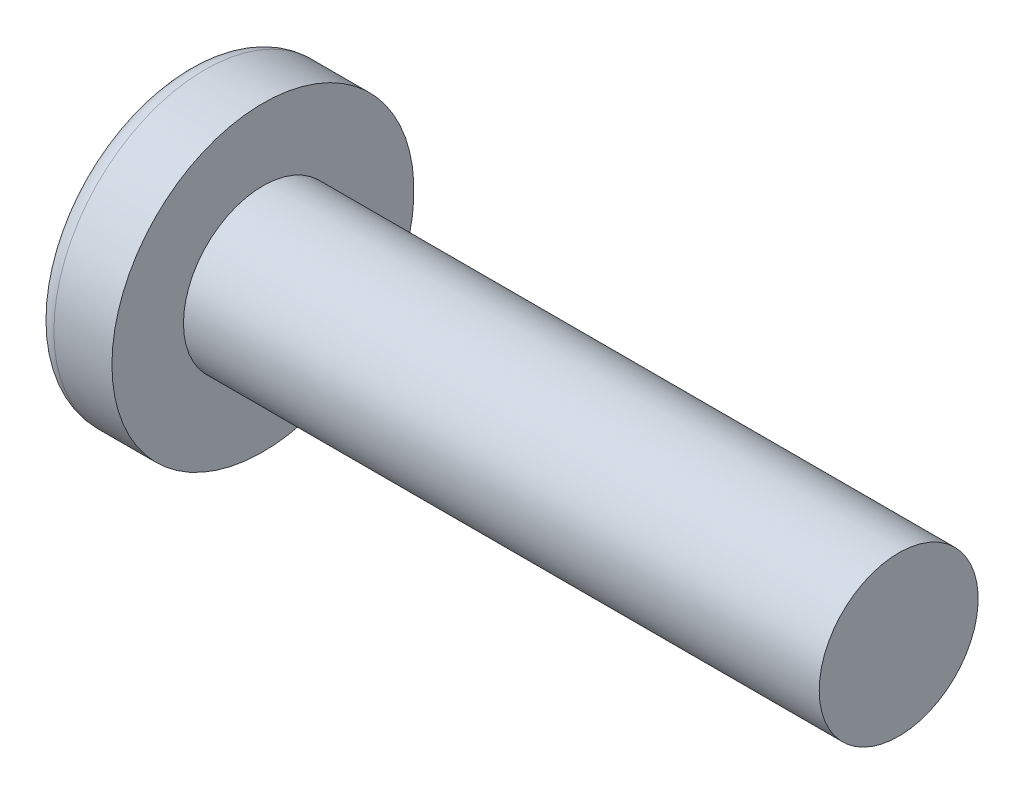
ISO-10303-21;
HEADER;
FILE_DESCRIPTION(('STEP AP214'),'2;1');
FILE_NAME('part.step','',(''),(''),'','','');
FILE_SCHEMA(('AUTOMOTIVE_DESIGN { 1 0 10303 214 1 1 1 1 }'));
ENDSEC;
DATA;
#1=APPLICATION_CONTEXT('core data for automotive mechanical design processes');
#2=APPLICATION_PROTOCOL_DEFINITION('international standard','automotive_design',2000,#1);
#3=PRODUCT_CONTEXT('',#1,'mechanical');
#4=PRODUCT('Part','Part','',(#3));
#5=PRODUCT_RELATED_PRODUCT_CATEGORY('part','',(#4));
#6=PRODUCT_DEFINITION_FORMATION('','',#4);
#7=PRODUCT_DEFINITION_CONTEXT('part definition',#1,'design');
#8=PRODUCT_DEFINITION('design','',#6,#7);
#9=PRODUCT_DEFINITION_SHAPE('','',#8);
#10=(LENGTH_UNIT() NAMED_UNIT(*) SI_UNIT(.MILLI.,.METRE.));
#11=(NAMED_UNIT(*) PLANE_ANGLE_UNIT() SI_UNIT($,.RADIAN.));
#12=(NAMED_UNIT(*) SI_UNIT($,.STERADIAN.) SOLID_ANGLE_UNIT());
#13=UNCERTAINTY_MEASURE_WITH_UNIT(LENGTH_MEASURE(1.E-05),#10,'distance_accuracy_value','');
#14=(GEOMETRIC_REPRESENTATION_CONTEXT(3) GLOBAL_UNCERTAINTY_ASSIGNED_CONTEXT((#13)) GLOBAL_UNIT_ASSIGNED_CONTEXT((#10,
#11,#12)) REPRESENTATION_CONTEXT('',''));
#15=CARTESIAN_POINT('',(0.,0.,0.));
#16=DIRECTION('',(0.,0.,1.));
#17=DIRECTION('',(1.,0.,0.));
#18=AXIS2_PLACEMENT_3D('',#15,#16,#17);
#19=CARTESIAN_POINT('',(8.,0.,0.));
#20=DIRECTION('',(-1.,0.,0.));
#21=DIRECTION('',(0.,1.,0.));
#22=AXIS2_PLACEMENT_3D('',#19,#20,#21);
#23=SPHERICAL_SURFACE('',#22,8.);
#24=CARTESIAN_POINT('',(1.37644815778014,0.,0.));
#25=DIRECTION('',(-1.,0.,0.));
#26=DIRECTION('',(0.,0.,1.));
#27=AXIS2_PLACEMENT_3D('',#24,#25,#26);
#28=CIRCLE('',#27,4.48648648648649);
#29=CARTESIAN_POINT('',(1.37644815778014,0.,4.48648648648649));
#30=VERTEX_POINT('',#29);
#31=EDGE_CURVE('E145',#30,#30,#28,.T.);
#32=ORIENTED_EDGE('',*,*,#31,.T.);
#33=EDGE_LOOP('',(#32));
#34=FACE_BOUND('',#33,.T.);
#35=CARTESIAN_POINT('',(7.98502567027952,-0.176697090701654,0.));
#36=DIRECTION('',(-0.0844430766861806,-0.996428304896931,0.));
#37=DIRECTION('',(0.996428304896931,-0.0844430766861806,0.));
#38=AXIS2_PLACEMENT_3D('',#35,#36,#37);
#39=CIRCLE('',#38,7.99803437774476);
#40=CARTESIAN_POINT('',(0.325131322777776,0.472446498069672,2.20752918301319));
#41=VERTEX_POINT('',#40);
#42=CARTESIAN_POINT('',(0.0309826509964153,0.497374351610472,0.497374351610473));
#43=VERTEX_POINT('',#42);
#44=EDGE_CURVE('E120',#41,#43,#39,.T.);
#45=ORIENTED_EDGE('',*,*,#44,.F.);
#46=CARTESIAN_POINT('',(6.31497138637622,0.,-2.25947018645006));
#47=DIRECTION('',(0.597823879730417,0.,0.801627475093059));
#48=DIRECTION('',(0.801627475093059,0.,-0.597823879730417));
#49=AXIS2_PLACEMENT_3D('',#46,#47,#48);
#50=CIRCLE('',#49,7.48702030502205);
#51=CARTESIAN_POINT('',(0.325131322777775,-0.472446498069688,2.20752918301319));
#52=VERTEX_POINT('',#51);
#53=EDGE_CURVE('E113',#41,#52,#50,.T.);
#54=ORIENTED_EDGE('',*,*,#53,.T.);
#55=CARTESIAN_POINT('',(7.98502567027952,0.176697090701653,0.));
#56=DIRECTION('',(-0.0844430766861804,0.996428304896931,0.));
#57=DIRECTION('',(-0.996428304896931,-0.0844430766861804,0.));
#58=AXIS2_PLACEMENT_3D('',#55,#56,#57);
#59=CIRCLE('',#58,7.99803437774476);
#60=CARTESIAN_POINT('',(0.0309826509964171,-0.497374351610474,0.497374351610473));
#61=VERTEX_POINT('',#60);
#62=EDGE_CURVE('E186',#61,#52,#59,.T.);
#63=ORIENTED_EDGE('',*,*,#62,.F.);
#64=CARTESIAN_POINT('',(7.98502567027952,0.,-0.176697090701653));
#65=DIRECTION('',(-0.0844430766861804,0.,-0.996428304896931));
#66=DIRECTION('',(-0.996428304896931,0.,0.0844430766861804));
#67=AXIS2_PLACEMENT_3D('',#64,#65,#66);
#68=CIRCLE('',#67,7.99803437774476);
#69=CARTESIAN_POINT('',(0.325131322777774,-2.20752918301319,0.472446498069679));
#70=VERTEX_POINT('',#69);
#71=EDGE_CURVE('E161',#70,#61,#68,.T.);
#72=ORIENTED_EDGE('',*,*,#71,.F.);
#73=CARTESIAN_POINT('',(6.31497138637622,2.25947018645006,0.));
#74=DIRECTION('',(0.597823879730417,-0.801627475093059,0.));
#75=DIRECTION('',(0.801627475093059,0.597823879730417,0.));
#76=AXIS2_PLACEMENT_3D('',#73,#74,#75);
#77=CIRCLE('',#76,7.48702030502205);
#78=CARTESIAN_POINT('',(0.325131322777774,-2.20752918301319,-0.47244649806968));
#79=VERTEX_POINT('',#78);
#80=EDGE_CURVE('E157',#70,#79,#77,.T.);
#81=ORIENTED_EDGE('',*,*,#80,.T.);
#82=CARTESIAN_POINT('',(7.98502567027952,0.,0.176697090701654));
#83=DIRECTION('',(-0.0844430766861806,0.,0.996428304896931));
#84=DIRECTION('',(0.996428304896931,0.,0.0844430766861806));
#85=AXIS2_PLACEMENT_3D('',#82,#83,#84);
#86=CIRCLE('',#85,7.99803437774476);
#87=CARTESIAN_POINT('',(0.0309826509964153,-0.497374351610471,-0.497374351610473));
#88=VERTEX_POINT('',#87);
#89=EDGE_CURVE('E41',#88,#79,#86,.T.);
#90=ORIENTED_EDGE('',*,*,#89,.F.);
#91=CARTESIAN_POINT('',(0.325131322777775,-0.472446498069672,-2.20752918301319));
#92=VERTEX_POINT('',#91);
#93=EDGE_CURVE('E183',#92,#88,#59,.T.);
#94=ORIENTED_EDGE('',*,*,#93,.F.);
#95=CARTESIAN_POINT('',(6.31497138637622,0.,2.25947018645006));
#96=DIRECTION('',(0.597823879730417,0.,-0.801627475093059));
#97=DIRECTION('',(-0.801627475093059,0.,-0.597823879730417));
#98=AXIS2_PLACEMENT_3D('',#95,#96,#97);
#99=CIRCLE('',#98,7.48702030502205);
#100=CARTESIAN_POINT('',(0.325131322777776,0.472446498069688,-2.20752918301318));
#101=VERTEX_POINT('',#100);
#102=EDGE_CURVE('E176',#92,#101,#99,.T.);
#103=ORIENTED_EDGE('',*,*,#102,.T.);
#104=CARTESIAN_POINT('',(0.0309826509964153,0.497374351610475,-0.497374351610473));
#105=VERTEX_POINT('',#104);
#106=EDGE_CURVE('E98',#105,#101,#39,.T.);
#107=ORIENTED_EDGE('',*,*,#106,.F.);
#108=CARTESIAN_POINT('',(0.325131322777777,2.20752918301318,-0.47244649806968));
#109=VERTEX_POINT('',#108);
#110=EDGE_CURVE('E34',#109,#105,#86,.T.);
#111=ORIENTED_EDGE('',*,*,#110,.F.);
#112=CARTESIAN_POINT('',(6.31497138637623,-2.25947018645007,0.));
#113=DIRECTION('',(0.597823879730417,0.801627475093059,0.));
#114=DIRECTION('',(-0.801627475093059,0.597823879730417,0.));
#115=AXIS2_PLACEMENT_3D('',#112,#113,#114);
#116=CIRCLE('',#115,7.48702030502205);
#117=CARTESIAN_POINT('',(0.325131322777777,2.20752918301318,0.47244649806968));
#118=VERTEX_POINT('',#117);
#119=EDGE_CURVE('E11',#109,#118,#116,.T.);
#120=ORIENTED_EDGE('',*,*,#119,.T.);
#121=EDGE_CURVE('E160',#43,#118,#68,.T.);
#122=ORIENTED_EDGE('',*,*,#121,.F.);
#123=EDGE_LOOP('',(#45,#54,#63,#72,#81,#90,#94,#103,#107,#111,#120,#122));
#124=FACE_BOUND('',#123,.T.);
#125=ADVANCED_FACE('F26',(#34,#124),#23,.T.);
#126=CARTESIAN_POINT('',(3.28522727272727,0.,-0.221590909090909));
#127=DIRECTION('',(-0.0844430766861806,0.,0.996428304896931));
#128=DIRECTION('',(0.996428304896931,0.,0.0844430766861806));
#129=AXIS2_PLACEMENT_3D('',#126,#127,#128);
#130=PLANE('',#129);
#131=ORIENTED_EDGE('',*,*,#110,.T.);
#132=DIRECTION('',(0.992894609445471,-0.0841436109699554,0.0841436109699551));
#133=VECTOR('',#132,1.);
#134=CARTESIAN_POINT('',(3.30374024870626,0.220022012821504,-0.220022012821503));
#135=LINE('',#134,#133);
#136=CARTESIAN_POINT('',(2.95,0.250000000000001,-0.249999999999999));
#137=VERTEX_POINT('',#136);
#138=EDGE_CURVE('E96',#105,#137,#135,.T.);
#139=ORIENTED_EDGE('',*,*,#138,.T.);
#140=DIRECTION('',(0.799784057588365,-0.596449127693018,0.0677783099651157));
#141=VECTOR('',#140,1.);
#142=CARTESIAN_POINT('',(0.,2.45,-0.5));
#143=LINE('',#142,#141);
#144=EDGE_CURVE('E118',#109,#137,#143,.T.);
#145=ORIENTED_EDGE('',*,*,#144,.F.);
#146=EDGE_LOOP('',(#131,#139,#145));
#147=FACE_BOUND('',#146,.T.);
#148=ADVANCED_FACE('F117',(#147),#130,.T.);
#149=DIRECTION('',(0.799784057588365,0.596449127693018,0.0677783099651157));
#150=VECTOR('',#149,1.);
#151=CARTESIAN_POINT('',(0.,-2.45,-0.5));
#152=LINE('',#151,#150);
#153=CARTESIAN_POINT('',(2.95,-0.25,-0.25));
#154=VERTEX_POINT('',#153);
#155=EDGE_CURVE('E139',#79,#154,#152,.T.);
#156=ORIENTED_EDGE('',*,*,#155,.T.);
#157=DIRECTION('',(-0.992894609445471,-0.0841436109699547,-0.0841436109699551));
#158=VECTOR('',#157,1.);
#159=CARTESIAN_POINT('',(3.30374024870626,-0.220022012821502,-0.220022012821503));
#160=LINE('',#159,#158);
#161=EDGE_CURVE('E184',#154,#88,#160,.T.);
#162=ORIENTED_EDGE('',*,*,#161,.T.);
#163=ORIENTED_EDGE('',*,*,#89,.T.);
#164=EDGE_LOOP('',(#156,#162,#163));
#165=FACE_BOUND('',#164,.T.);
#166=ADVANCED_FACE('F218',(#165),#130,.T.);
#167=CARTESIAN_POINT('',(3.28522727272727,0.,0.221590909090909));
#168=DIRECTION('',(-0.0844430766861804,0.,-0.996428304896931));
#169=DIRECTION('',(-0.996428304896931,0.,0.0844430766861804));
#170=AXIS2_PLACEMENT_3D('',#167,#168,#169);
#171=PLANE('',#170);
#172=DIRECTION('',(0.799784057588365,-0.596449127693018,-0.0677783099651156));
#173=VECTOR('',#172,1.);
#174=CARTESIAN_POINT('',(0.,2.45,0.5));
#175=LINE('',#174,#173);
#176=CARTESIAN_POINT('',(2.95,0.25,0.25));
#177=VERTEX_POINT('',#176);
#178=EDGE_CURVE('E125',#118,#177,#175,.T.);
#179=ORIENTED_EDGE('',*,*,#178,.T.);
#180=DIRECTION('',(-0.992894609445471,0.0841436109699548,0.084143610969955));
#181=VECTOR('',#180,1.);
#182=CARTESIAN_POINT('',(3.30374024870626,0.220022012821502,0.220022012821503));
#183=LINE('',#182,#181);
#184=EDGE_CURVE('E172',#177,#43,#183,.T.);
#185=ORIENTED_EDGE('',*,*,#184,.T.);
#186=ORIENTED_EDGE('',*,*,#121,.T.);
#187=EDGE_LOOP('',(#179,#185,#186));
#188=FACE_BOUND('',#187,.T.);
#189=ADVANCED_FACE('F170',(#188),#171,.T.);
#190=ORIENTED_EDGE('',*,*,#71,.T.);
#191=DIRECTION('',(0.992894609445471,0.0841436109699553,-0.0841436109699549));
#192=VECTOR('',#191,1.);
#193=CARTESIAN_POINT('',(3.30374024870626,-0.220022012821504,0.220022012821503));
#194=LINE('',#193,#192);
#195=CARTESIAN_POINT('',(2.95,-0.250000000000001,0.249999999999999));
#196=VERTEX_POINT('',#195);
#197=EDGE_CURVE('E189',#61,#196,#194,.T.);
#198=ORIENTED_EDGE('',*,*,#197,.T.);
#199=DIRECTION('',(0.799784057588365,0.596449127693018,-0.0677783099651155));
#200=VECTOR('',#199,1.);
#201=CARTESIAN_POINT('',(0.,-2.45,0.499999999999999));
#202=LINE('',#201,#200);
#203=EDGE_CURVE('E136',#70,#196,#202,.T.);
#204=ORIENTED_EDGE('',*,*,#203,.F.);
#205=EDGE_LOOP('',(#190,#198,#204));
#206=FACE_BOUND('',#205,.T.);
#207=ADVANCED_FACE('F237',(#206),#171,.T.);
#208=CARTESIAN_POINT('',(-25.4,0.,0.));
#209=DIRECTION('',(-1.,0.,0.));
#210=DIRECTION('',(0.,0.,1.));
#211=AXIS2_PLACEMENT_3D('',#208,#209,#210);
#212=CYLINDRICAL_SURFACE('',#211,2.5);
#213=CARTESIAN_POINT('',(23.7,0.,0.));
#214=DIRECTION('',(-1.,0.,0.));
#215=DIRECTION('',(0.,0.,1.));
#216=AXIS2_PLACEMENT_3D('',#213,#214,#215);
#217=CIRCLE('',#216,2.5);
#218=CARTESIAN_POINT('',(23.7,0.,2.5));
#219=VERTEX_POINT('',#218);
#220=EDGE_CURVE('E124',#219,#219,#217,.T.);
#221=ORIENTED_EDGE('',*,*,#220,.T.);
#222=EDGE_LOOP('',(#221));
#223=FACE_BOUND('',#222,.T.);
#224=CARTESIAN_POINT('',(3.7,0.,0.));
#225=DIRECTION('',(-1.,0.,0.));
#226=DIRECTION('',(0.,0.,1.));
#227=AXIS2_PLACEMENT_3D('',#224,#225,#226);
#228=CIRCLE('',#227,2.5);
#229=CARTESIAN_POINT('',(3.7,0.,2.5));
#230=VERTEX_POINT('',#229);
#231=EDGE_CURVE('E154',#230,#230,#228,.T.);
#232=ORIENTED_EDGE('',*,*,#231,.F.);
#233=EDGE_LOOP('',(#232));
#234=FACE_BOUND('',#233,.T.);
#235=ADVANCED_FACE('F28',(#223,#234),#212,.T.);
#236=CARTESIAN_POINT('',(3.7,2.5,0.));
#237=DIRECTION('',(-1.,0.,0.));
#238=DIRECTION('',(0.,0.,1.));
#239=AXIS2_PLACEMENT_3D('',#236,#237,#238);
#240=PLANE('',#239);
#241=CARTESIAN_POINT('',(3.7,0.,0.));
#242=DIRECTION('',(-1.,0.,0.));
#243=DIRECTION('',(0.,0.,1.));
#244=AXIS2_PLACEMENT_3D('',#241,#242,#243);
#245=CIRCLE('',#244,4.75);
#246=CARTESIAN_POINT('',(3.7,0.,4.75));
#247=VERTEX_POINT('',#246);
#248=EDGE_CURVE('E151',#247,#247,#245,.T.);
#249=ORIENTED_EDGE('',*,*,#248,.F.);
#250=EDGE_LOOP('',(#249));
#251=FACE_BOUND('',#250,.T.);
#252=ORIENTED_EDGE('',*,*,#231,.T.);
#253=EDGE_LOOP('',(#252));
#254=FACE_BOUND('',#253,.T.);
#255=ADVANCED_FACE('F230',(#251,#254),#240,.F.);
#256=CARTESIAN_POINT('',(-25.4,0.,0.));
#257=DIRECTION('',(-1.,0.,0.));
#258=DIRECTION('',(0.,0.,1.));
#259=AXIS2_PLACEMENT_3D('',#256,#257,#258);
#260=CYLINDRICAL_SURFACE('',#259,4.75);
#261=ORIENTED_EDGE('',*,*,#248,.T.);
#262=EDGE_LOOP('',(#261));
#263=FACE_BOUND('',#262,.T.);
#264=CARTESIAN_POINT('',(1.87321454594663,0.,0.));
#265=DIRECTION('',(-1.,0.,0.));
#266=DIRECTION('',(0.,0.,1.));
#267=AXIS2_PLACEMENT_3D('',#264,#265,#266);
#268=CIRCLE('',#267,4.75);
#269=CARTESIAN_POINT('',(1.87321454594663,0.,4.75));
#270=VERTEX_POINT('',#269);
#271=EDGE_CURVE('E148',#270,#270,#268,.T.);
#272=ORIENTED_EDGE('',*,*,#271,.F.);
#273=EDGE_LOOP('',(#272));
#274=FACE_BOUND('',#273,.T.);
#275=ADVANCED_FACE('F227',(#263,#274),#260,.T.);
#276=CARTESIAN_POINT('',(1.87321454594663,0.,0.));
#277=DIRECTION('',(-1.,0.,0.));
#278=DIRECTION('',(0.,0.,1.));
#279=AXIS2_PLACEMENT_3D('',#276,#277,#278);
#280=TOROIDAL_SURFACE('',#279,4.15,0.599999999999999);
#281=ORIENTED_EDGE('',*,*,#271,.T.);
#282=EDGE_LOOP('',(#281));
#283=FACE_BOUND('',#282,.T.);
#284=ORIENTED_EDGE('',*,*,#31,.F.);
#285=EDGE_LOOP('',(#284));
#286=FACE_BOUND('',#285,.T.);
#287=ADVANCED_FACE('F224',(#283,#286),#280,.T.);
#288=CARTESIAN_POINT('',(23.7,2.5,0.));
#289=DIRECTION('',(1.,0.,0.));
#290=DIRECTION('',(0.,0.,-1.));
#291=AXIS2_PLACEMENT_3D('',#288,#289,#290);
#292=PLANE('',#291);
#293=ORIENTED_EDGE('',*,*,#220,.F.);
#294=EDGE_LOOP('',(#293));
#295=FACE_BOUND('',#294,.T.);
#296=ADVANCED_FACE('F222',(#295),#292,.T.);
#297=CARTESIAN_POINT('',(2.95,0.25,0.25));
#298=DIRECTION('',(0.597823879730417,0.801627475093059,0.));
#299=DIRECTION('',(-0.801627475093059,0.597823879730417,0.));
#300=AXIS2_PLACEMENT_3D('',#297,#298,#299);
#301=PLANE('',#300);
#302=ORIENTED_EDGE('',*,*,#144,.T.);
#303=DIRECTION('',(0.,0.,-1.));
#304=VECTOR('',#303,1.);
#305=CARTESIAN_POINT('',(2.95,0.25,0.25));
#306=LINE('',#305,#304);
#307=EDGE_CURVE('E112',#177,#137,#306,.T.);
#308=ORIENTED_EDGE('',*,*,#307,.F.);
#309=ORIENTED_EDGE('',*,*,#178,.F.);
#310=ORIENTED_EDGE('',*,*,#119,.F.);
#311=EDGE_LOOP('',(#302,#308,#309,#310));
#312=FACE_BOUND('',#311,.T.);
#313=ADVANCED_FACE('F123',(#312),#301,.F.);
#314=CARTESIAN_POINT('',(2.95,-0.25,-0.25));
#315=DIRECTION('',(0.597823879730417,-0.801627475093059,0.));
#316=DIRECTION('',(0.801627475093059,0.597823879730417,0.));
#317=AXIS2_PLACEMENT_3D('',#314,#315,#316);
#318=PLANE('',#317);
#319=ORIENTED_EDGE('',*,*,#203,.T.);
#320=DIRECTION('',(0.,0.,1.));
#321=VECTOR('',#320,1.);
#322=CARTESIAN_POINT('',(2.95,-0.25,-0.25));
#323=LINE('',#322,#321);
#324=EDGE_CURVE('E132',#154,#196,#323,.T.);
#325=ORIENTED_EDGE('',*,*,#324,.F.);
#326=ORIENTED_EDGE('',*,*,#155,.F.);
#327=ORIENTED_EDGE('',*,*,#80,.F.);
#328=EDGE_LOOP('',(#319,#325,#326,#327));
#329=FACE_BOUND('',#328,.T.);
#330=ADVANCED_FACE('F256',(#329),#318,.F.);
#331=CARTESIAN_POINT('',(2.95,0.25,-0.25));
#332=DIRECTION('',(-1.,0.,0.));
#333=DIRECTION('',(0.,0.,1.));
#334=AXIS2_PLACEMENT_3D('',#331,#332,#333);
#335=PLANE('',#334);
#336=DIRECTION('',(0.,1.,0.));
#337=VECTOR('',#336,1.);
#338=CARTESIAN_POINT('',(2.95,-0.25,-0.25));
#339=LINE('',#338,#337);
#340=EDGE_CURVE('E105',#154,#137,#339,.T.);
#341=ORIENTED_EDGE('',*,*,#340,.F.);
#342=ORIENTED_EDGE('',*,*,#324,.T.);
#343=DIRECTION('',(0.,-1.,0.));
#344=VECTOR('',#343,1.);
#345=CARTESIAN_POINT('',(2.95,0.25,0.25));
#346=LINE('',#345,#344);
#347=EDGE_CURVE('E130',#177,#196,#346,.T.);
#348=ORIENTED_EDGE('',*,*,#347,.F.);
#349=ORIENTED_EDGE('',*,*,#307,.T.);
#350=EDGE_LOOP('',(#341,#342,#348,#349));
#351=FACE_BOUND('',#350,.T.);
#352=ADVANCED_FACE('F128',(#351),#335,.T.);
#353=CARTESIAN_POINT('',(2.95,0.250000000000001,-0.249999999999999));
#354=DIRECTION('',(0.597823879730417,0.,-0.801627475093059));
#355=DIRECTION('',(0.801627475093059,0.,0.597823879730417));
#356=AXIS2_PLACEMENT_3D('',#353,#354,#355);
#357=PLANE('',#356);
#358=DIRECTION('',(0.799784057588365,0.0677783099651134,0.596449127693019));
#359=VECTOR('',#358,1.);
#360=CARTESIAN_POINT('',(0.,-0.499999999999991,-2.45));
#361=LINE('',#360,#359);
#362=EDGE_CURVE('E102',#92,#154,#361,.T.);
#363=ORIENTED_EDGE('',*,*,#362,.T.);
#364=ORIENTED_EDGE('',*,*,#340,.T.);
#365=DIRECTION('',(0.799784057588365,-0.0677783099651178,0.596449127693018));
#366=VECTOR('',#365,1.);
#367=CARTESIAN_POINT('',(0.,0.500000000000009,-2.45));
#368=LINE('',#367,#366);
#369=EDGE_CURVE('E92',#101,#137,#368,.T.);
#370=ORIENTED_EDGE('',*,*,#369,.F.);
#371=ORIENTED_EDGE('',*,*,#102,.F.);
#372=EDGE_LOOP('',(#363,#364,#370,#371));
#373=FACE_BOUND('',#372,.T.);
#374=ADVANCED_FACE('F106',(#373),#357,.F.);
#375=CARTESIAN_POINT('',(3.28522727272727,-0.221590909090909,0.));
#376=DIRECTION('',(-0.0844430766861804,0.996428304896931,0.));
#377=DIRECTION('',(-0.996428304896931,-0.0844430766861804,0.));
#378=AXIS2_PLACEMENT_3D('',#375,#376,#377);
#379=PLANE('',#378);
#380=ORIENTED_EDGE('',*,*,#93,.T.);
#381=ORIENTED_EDGE('',*,*,#161,.F.);
#382=ORIENTED_EDGE('',*,*,#362,.F.);
#383=EDGE_LOOP('',(#380,#381,#382));
#384=FACE_BOUND('',#383,.T.);
#385=ADVANCED_FACE('F208',(#384),#379,.T.);
#386=CARTESIAN_POINT('',(3.28522727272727,0.221590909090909,0.));
#387=DIRECTION('',(-0.0844430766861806,-0.996428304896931,0.));
#388=DIRECTION('',(0.996428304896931,-0.0844430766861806,0.));
#389=AXIS2_PLACEMENT_3D('',#386,#387,#388);
#390=PLANE('',#389);
#391=ORIENTED_EDGE('',*,*,#106,.T.);
#392=ORIENTED_EDGE('',*,*,#369,.T.);
#393=ORIENTED_EDGE('',*,*,#138,.F.);
#394=EDGE_LOOP('',(#391,#392,#393));
#395=FACE_BOUND('',#394,.T.);
#396=ADVANCED_FACE('F94',(#395),#390,.T.);
#397=CARTESIAN_POINT('',(2.95,-0.250000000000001,0.249999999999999));
#398=DIRECTION('',(0.597823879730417,0.,0.801627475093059));
#399=DIRECTION('',(-0.801627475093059,0.,0.597823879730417));
#400=AXIS2_PLACEMENT_3D('',#397,#398,#399);
#401=PLANE('',#400);
#402=DIRECTION('',(0.799784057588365,-0.0677783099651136,-0.596449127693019));
#403=VECTOR('',#402,1.);
#404=CARTESIAN_POINT('',(0.,0.499999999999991,2.45));
#405=LINE('',#404,#403);
#406=EDGE_CURVE('E192',#41,#177,#405,.T.);
#407=ORIENTED_EDGE('',*,*,#406,.T.);
#408=ORIENTED_EDGE('',*,*,#347,.T.);
#409=DIRECTION('',(0.799784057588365,0.0677783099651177,-0.596449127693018));
#410=VECTOR('',#409,1.);
#411=CARTESIAN_POINT('',(0.,-0.500000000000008,2.45));
#412=LINE('',#411,#410);
#413=EDGE_CURVE('E101',#52,#196,#412,.T.);
#414=ORIENTED_EDGE('',*,*,#413,.F.);
#415=ORIENTED_EDGE('',*,*,#53,.F.);
#416=EDGE_LOOP('',(#407,#408,#414,#415));
#417=FACE_BOUND('',#416,.T.);
#418=ADVANCED_FACE('F196',(#417),#401,.F.);
#419=ORIENTED_EDGE('',*,*,#44,.T.);
#420=ORIENTED_EDGE('',*,*,#184,.F.);
#421=ORIENTED_EDGE('',*,*,#406,.F.);
#422=EDGE_LOOP('',(#419,#420,#421));
#423=FACE_BOUND('',#422,.T.);
#424=ADVANCED_FACE('F198',(#423),#390,.T.);
#425=ORIENTED_EDGE('',*,*,#62,.T.);
#426=ORIENTED_EDGE('',*,*,#413,.T.);
#427=ORIENTED_EDGE('',*,*,#197,.F.);
#428=EDGE_LOOP('',(#425,#426,#427));
#429=FACE_BOUND('',#428,.T.);
#430=ADVANCED_FACE('F200',(#429),#379,.T.);
#431=CLOSED_SHELL('',(#125,#148,#166,#189,#207,#235,#255,#275,#287,#296,#313,#330,#352,#374,
#385,#396,#418,#424,#430));
#432=MANIFOLD_SOLID_BREP('B2',#431);
#433=ADVANCED_BREP_SHAPE_REPRESENTATION('',(#18,#432),#14);
#434=SHAPE_DEFINITION_REPRESENTATION(#9,#433);
ENDSEC;
END-ISO-10303-21;
